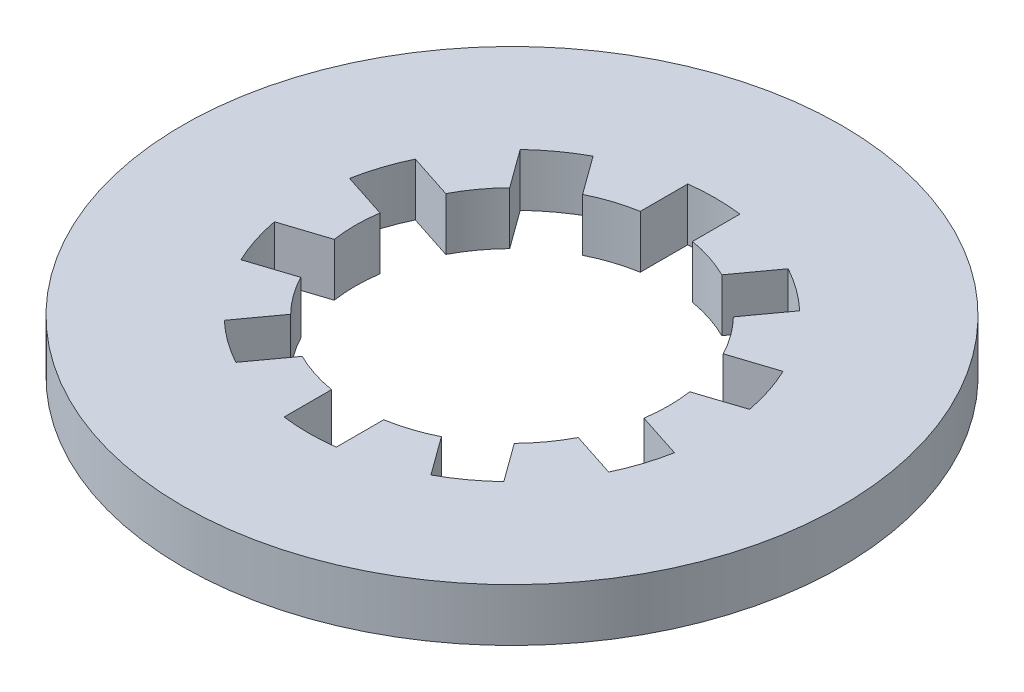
from build123d import *

# Parameters (mm, degrees)
SKETCH1_R          = 2.54
SKETCH1_R_2        = 1.2065
EXTRUDE1_DEPTH     = 0.4064
CUT_EXTRUDE1_DEPTH = 4.615018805
CIRPATTERN1_COUNT  = 10


with BuildPart() as part:
    # Sketch1 → Extrude1 (new body)
    with BuildSketch(Plane(origin=(0, 0, 0), x_dir=(1, 0, 0), z_dir=(0, 1, 0))):
        with Locations(Location((0, 0, 0), (0, 0, 270))):
            Circle(SKETCH1_R)
        with Locations(Location((0, 0, 0), (0, 0, 270))):
            Circle(SKETCH1_R_2, mode=Mode.SUBTRACT)
    extrude(amount=EXTRUDE1_DEPTH)

    # Sketch2 → Cut-Extrude1 (cut, through all)
    with BuildSketch(Plane(origin=(0, 0.4064, 0), x_dir=(-1, 0, 0), z_dir=(0, 1, 0))):
        with BuildLine():
            Line((-0.201083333, 1.555506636), (-0.201083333, 1.189625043))
            ThreePointArc((-0.201083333, 1.189625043), (0, 1.2065), (0.201083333, 1.189625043))
            Line((0.201083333, 1.189625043), (0.201083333, 1.555506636))
            ThreePointArc((0.201083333, 1.555506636), (0, 1.56845), (-0.201083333, 1.555506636))
        make_face()
    cut_extrude1 = extrude(amount=-CUT_EXTRUDE1_DEPTH, mode=Mode.SUBTRACT)

    # CirPattern1: Cut-Extrude1 ×10 about axis
    cirpattern1_axis = Axis((0, 0, 0), (0, 1, 0))
    for i in range(1, CIRPATTERN1_COUNT):
        add(cut_extrude1.rotate(cirpattern1_axis, i * 360 / CIRPATTERN1_COUNT), mode=Mode.SUBTRACT)


solid = part.part
